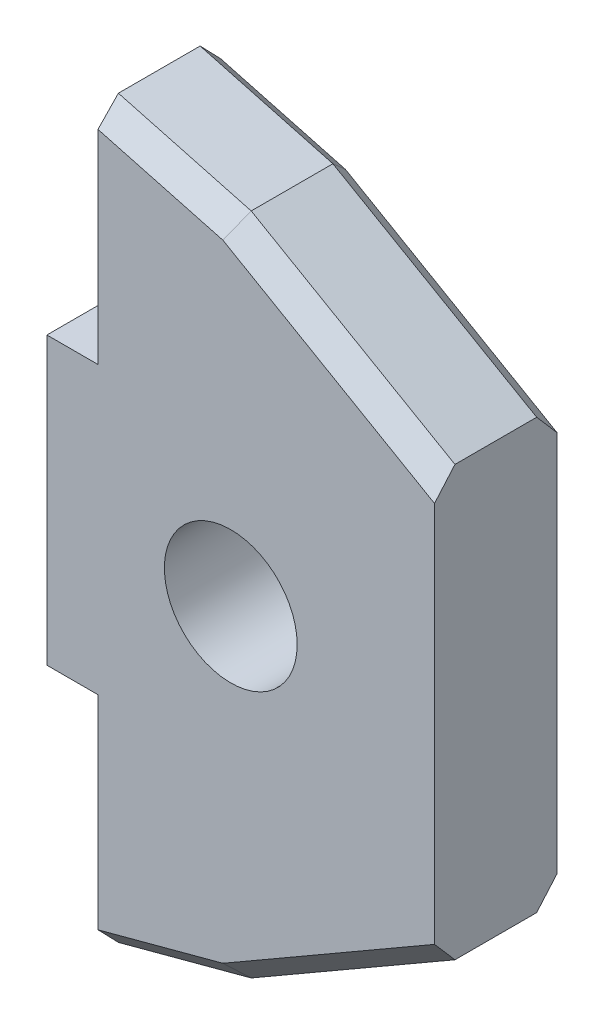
from build123d import *

# Parameters (mm, degrees)
SKETCH_1_R      = 6.5
EXTRUDE_1_DEPTH = 12
CHAMFER_1_SIZE  = 2


with BuildPart() as part:
    # Sketch 1 → Extrude 1 (new body)
    with BuildSketch(Plane.XY):
        Polygon((-18, -14), (-18, 14), (-13, 14), (-13, 36), (0, 32.516660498), (19.947441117, 21), (19.947441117, -21), (0, -32.516660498), (-13, -36), (-13, -14), align=None)
        Circle(SKETCH_1_R, mode=Mode.SUBTRACT)
    extrude(amount=EXTRUDE_1_DEPTH)

    # Chamfer 1
    chamfer_1_edges = [part.edges().sort_by_distance(p)[0] for p in [
        (9.973720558, -26.758330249, 0),
        (-6.5, -34.258330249, 0),
        (-6.5, 34.258330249, 0),
        (9.973720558, 26.758330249, 0),
        (-6.5, -34.258330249, 12),
        (9.973720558, -26.758330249, 12),
        (9.973720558, 26.758330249, 12),
        (-6.5, 34.258330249, 12),
    ]]
    chamfer(chamfer_1_edges, length=CHAMFER_1_SIZE)


solid = part.part
